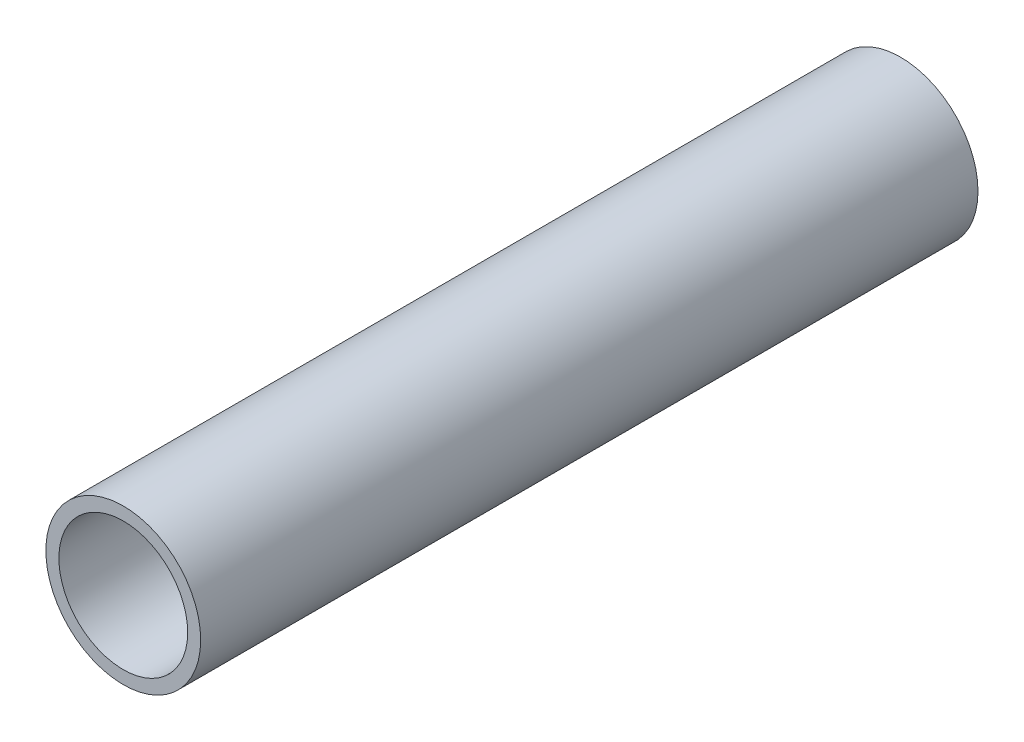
from build123d import *

# Parameters (mm, degrees)
ESQUISSE1_R             = 2.975
EXTRUSION1_DEPTH        = 29.87
ESQUISSE2_R             = 2.475
ENL_V_MAT_EXTRU_1_DEPTH = 31.164849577


with BuildPart() as part:
    # Esquisse1 → Extrusion1 (new body)
    with BuildSketch(Plane.XY):
        Circle(ESQUISSE1_R)
    extrude(amount=EXTRUSION1_DEPTH)

    # Esquisse2 → Enl_v. mat.-Extru.1 (cut, through all)
    with BuildSketch(Plane.XY.offset(29.87)):
        Circle(ESQUISSE2_R)
    extrude(amount=-ENL_V_MAT_EXTRU_1_DEPTH, mode=Mode.SUBTRACT)


solid = part.part
